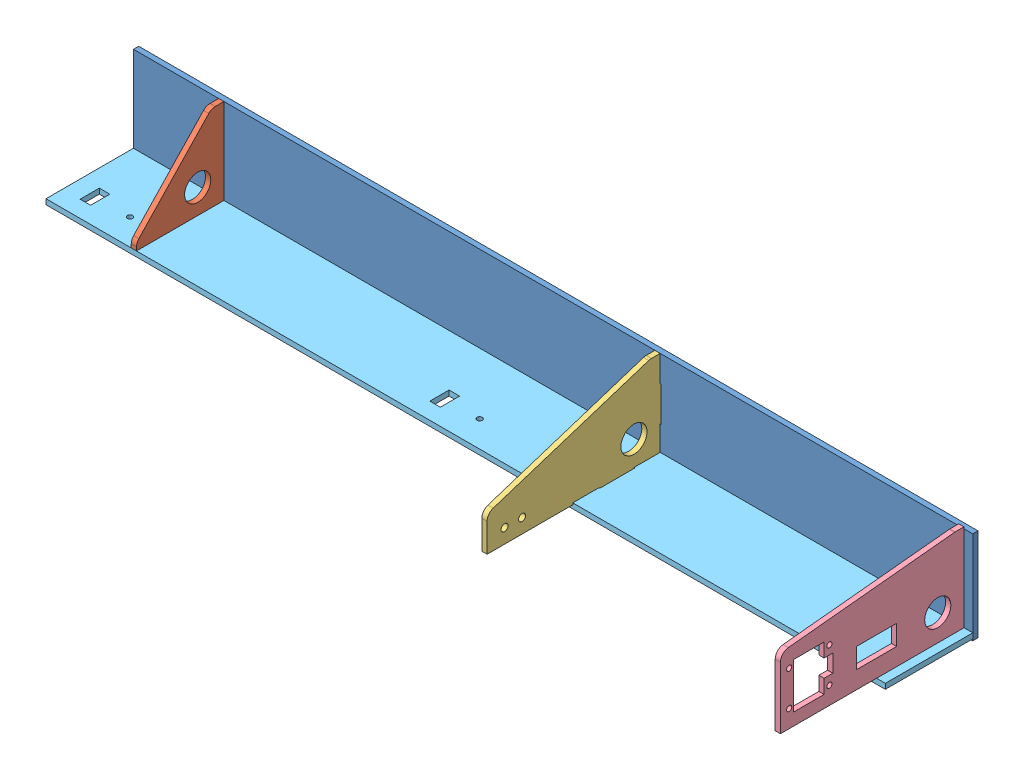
SolidWorks assembly CHRONO.SLDASM, configuration Défaut (file format 14000). Lengths in mm.
Overall size (480 53.97 108).
5 component instances, 5 part files, 12 mates.
Components (placement in the parent):
- Base_Chrono-1: Base_Chrono.SLDPRT [Défaut] at (-233.5819 -0.9316 498.5) size (480 53 3)
- PIed1_Chrono-1: PIed1_Chrono.SLDPRT [Défaut] at (-184.8319 -0.9316 501.5) x (0 1 0) z (1 0 0) size (53 53 3)
- PIed2_Chrono-1: PIed2_Chrono.SLDPRT [Défaut] at (64.6681 -0.9316 501.5) x (0 1 0) z (1 0 0) size (53 102 3)
- PIed3_Chrono-1: PIed3_Chrono.SLDPRT [Défaut] at (238.4181 0.0405 501.5) x (0 1 0) z (1 0 0) size (53 108 3)
- Bande_Chrono-1: Bande_Chrono.SLDPRT [Défaut] at (-233.5819 0.0405 501.5) x (1 0 0) z (0 -1 0) size (480 50 3)
Mates (geometry in assembly coordinates):
- Coïncidente1: coincident anti-aligned: plane of Base_Chrono-1 through (-233.5819 -0.9316 501.5) normal (0 0 1); plane of PIed1_Chrono-1 through (-181.8319 49.0684 501.5) normal (0 0 -1)
- Coïncidente2: coincident anti-aligned: plane of Base_Chrono-1 through (-181.8319 34.0684 501.5) normal (-1 0 0); plane of PIed1_Chrono-1 through (-181.8319 2.0684 546.5) normal (1 0 0)
- Coïncidente3: coincident anti-aligned: plane of Base_Chrono-1 through (-185.3319 14.0684 501.5) normal (0 1 0); plane of PIed1_Chrono-1 through (-181.8319 14.0684 501.5) normal (0 -1 0)
- Coïncidente4: coincident anti-aligned: plane of Base_Chrono-1 through (64.6681 14.0684 501.5) normal (0 1 0); plane of PIed2_Chrono-1 through (67.6681 14.0684 501.5) normal (0 -1 0)
- Coïncidente5: coincident anti-aligned: plane of Base_Chrono-1 through (-233.5819 -0.9316 501.5) normal (0 0 1); plane of PIed2_Chrono-1 through (67.6681 49.0684 501.5) normal (0 0 -1)
- Coïncidente6: coincident anti-aligned: plane of Base_Chrono-1 through (64.6681 34.0684 501.5) normal (1 0 0); plane of PIed2_Chrono-1 through (64.6681 15.425 595.5) normal (-1 0 0)
- Coïncidente7: coincident anti-aligned: plane of Base_Chrono-1 through (237.9181 35.0405 501.5) normal (0 -1 0); plane of PIed3_Chrono-1 through (241.4181 35.0405 498.5) normal (0 1 0)
- Coïncidente8: coincident anti-aligned: plane of Base_Chrono-1 through (241.4181 35.0405 501.5) normal (-1 0 0); plane of PIed3_Chrono-1 through (241.4181 35.5167 601.5) normal (1 0 0)
- Coïncidente9: coincident anti-aligned: plane of Base_Chrono-1 through (-233.5819 -0.9316 501.5) normal (0 0 1); plane of PIed3_Chrono-1 through (241.4181 15.0405 501.5) normal (0 0 -1)
- Coïncidente13: coincident anti-aligned: plane of PIed3_Chrono-1 through (241.4181 0.0405 536.5) normal (0 -1 0); plane of Bande_Chrono-1 through (-233.5819 0.0405 501.5) normal (0 1 0)
- Coïncidente14: coincident anti-aligned: plane of PIed3_Chrono-1 through (241.4181 35.5167 601.5) normal (1 0 0); plane of Bande_Chrono-1 through (241.4181 -2.9595 536.5) normal (-1 0 0)
- Coïncidente15: coincident anti-aligned: plane of PIed3_Chrono-1 through (241.4181 0.0405 516.5) normal (0 0 -1); plane of Bande_Chrono-1 through (237.9181 -2.9595 516.5) normal (0 0 1)
